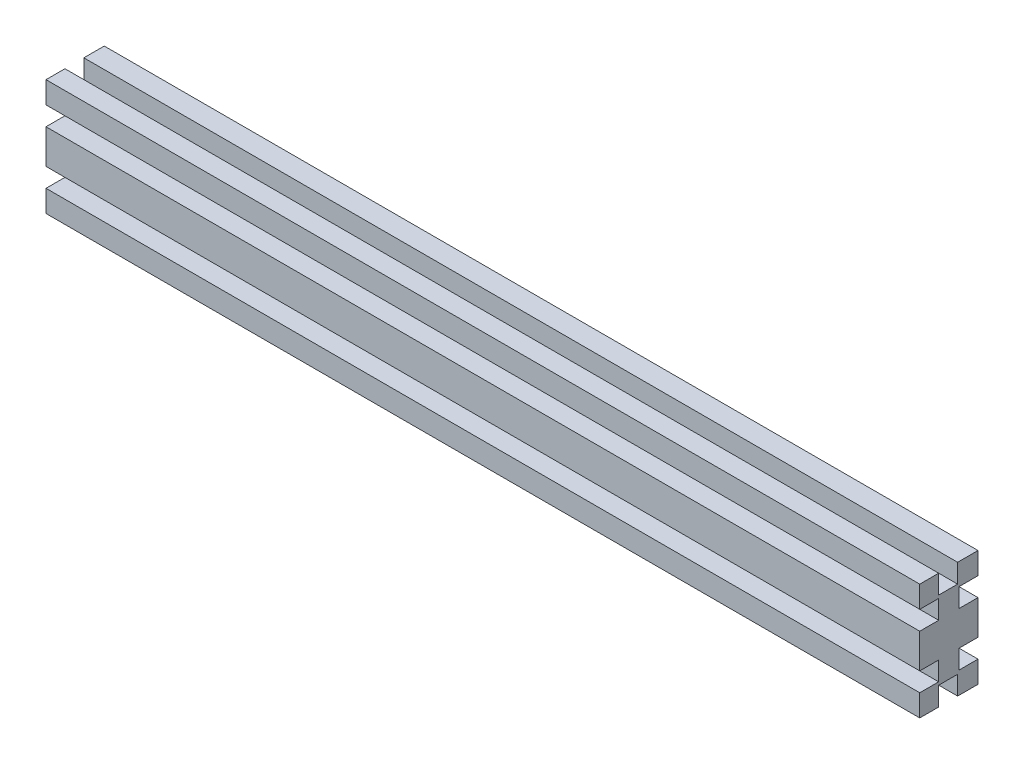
ISO-10303-21;
HEADER;
FILE_DESCRIPTION(('STEP AP214'),'2;1');
FILE_NAME('part.step','',(''),(''),'','','');
FILE_SCHEMA(('AUTOMOTIVE_DESIGN { 1 0 10303 214 1 1 1 1 }'));
ENDSEC;
DATA;
#1=APPLICATION_CONTEXT('core data for automotive mechanical design processes');
#2=APPLICATION_PROTOCOL_DEFINITION('international standard','automotive_design',2000,#1);
#3=PRODUCT_CONTEXT('',#1,'mechanical');
#4=PRODUCT('Part','Part','',(#3));
#5=PRODUCT_RELATED_PRODUCT_CATEGORY('part','',(#4));
#6=PRODUCT_DEFINITION_FORMATION('','',#4);
#7=PRODUCT_DEFINITION_CONTEXT('part definition',#1,'design');
#8=PRODUCT_DEFINITION('design','',#6,#7);
#9=PRODUCT_DEFINITION_SHAPE('','',#8);
#10=(LENGTH_UNIT() NAMED_UNIT(*) SI_UNIT(.MILLI.,.METRE.));
#11=(NAMED_UNIT(*) PLANE_ANGLE_UNIT() SI_UNIT($,.RADIAN.));
#12=(NAMED_UNIT(*) SI_UNIT($,.STERADIAN.) SOLID_ANGLE_UNIT());
#13=UNCERTAINTY_MEASURE_WITH_UNIT(LENGTH_MEASURE(1.E-05),#10,'distance_accuracy_value','');
#14=(GEOMETRIC_REPRESENTATION_CONTEXT(3) GLOBAL_UNCERTAINTY_ASSIGNED_CONTEXT((#13)) GLOBAL_UNIT_ASSIGNED_CONTEXT((#10,
#11,#12)) REPRESENTATION_CONTEXT('',''));
#15=CARTESIAN_POINT('',(0.,0.,0.));
#16=DIRECTION('',(0.,0.,1.));
#17=DIRECTION('',(1.,0.,0.));
#18=AXIS2_PLACEMENT_3D('',#15,#16,#17);
#19=CARTESIAN_POINT('',(300.,-19.9006863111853,-3.));
#20=DIRECTION('',(0.,1.,0.));
#21=DIRECTION('',(0.,0.,1.));
#22=AXIS2_PLACEMENT_3D('',#19,#20,#21);
#23=PLANE('',#22);
#24=DIRECTION('',(0.,0.,-1.));
#25=VECTOR('',#24,1.);
#26=CARTESIAN_POINT('',(0.,-19.9006863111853,-3.));
#27=LINE('',#26,#25);
#28=CARTESIAN_POINT('',(0.,-19.9006863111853,-3.));
#29=VERTEX_POINT('',#28);
#30=CARTESIAN_POINT('',(0.,-19.9006863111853,-10.));
#31=VERTEX_POINT('',#30);
#32=EDGE_CURVE('E266',#29,#31,#27,.T.);
#33=ORIENTED_EDGE('',*,*,#32,.T.);
#34=DIRECTION('',(-1.,0.,0.));
#35=VECTOR('',#34,1.);
#36=CARTESIAN_POINT('',(300.,-19.9006863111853,-10.));
#37=LINE('',#36,#35);
#38=CARTESIAN_POINT('',(300.,-19.9006863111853,-10.));
#39=VERTEX_POINT('',#38);
#40=EDGE_CURVE('E11',#39,#31,#37,.T.);
#41=ORIENTED_EDGE('',*,*,#40,.F.);
#42=DIRECTION('',(0.,0.,-1.));
#43=VECTOR('',#42,1.);
#44=CARTESIAN_POINT('',(300.,-19.9006863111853,-3.));
#45=LINE('',#44,#43);
#46=CARTESIAN_POINT('',(300.,-19.9006863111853,-3.));
#47=VERTEX_POINT('',#46);
#48=EDGE_CURVE('E348',#47,#39,#45,.T.);
#49=ORIENTED_EDGE('',*,*,#48,.F.);
#50=DIRECTION('',(-1.,0.,0.));
#51=VECTOR('',#50,1.);
#52=CARTESIAN_POINT('',(300.,-19.9006863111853,-3.));
#53=LINE('',#52,#51);
#54=EDGE_CURVE('E262',#47,#29,#53,.T.);
#55=ORIENTED_EDGE('',*,*,#54,.T.);
#56=EDGE_LOOP('',(#33,#41,#49,#55));
#57=FACE_BOUND('',#56,.T.);
#58=ADVANCED_FACE('F45',(#57),#23,.F.);
#59=CARTESIAN_POINT('',(300.,-12.4006863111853,-10.));
#60=DIRECTION('',(0.,0.,1.));
#61=DIRECTION('',(0.,-1.,0.));
#62=AXIS2_PLACEMENT_3D('',#59,#60,#61);
#63=PLANE('',#62);
#64=DIRECTION('',(0.,1.,0.));
#65=VECTOR('',#64,1.);
#66=CARTESIAN_POINT('',(0.,-12.4006863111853,-10.));
#67=LINE('',#66,#65);
#68=CARTESIAN_POINT('',(0.,-12.4006863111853,-10.));
#69=VERTEX_POINT('',#68);
#70=EDGE_CURVE('E270',#31,#69,#67,.T.);
#71=ORIENTED_EDGE('',*,*,#70,.T.);
#72=DIRECTION('',(-1.,0.,0.));
#73=VECTOR('',#72,1.);
#74=CARTESIAN_POINT('',(300.,-12.4006863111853,-10.));
#75=LINE('',#74,#73);
#76=CARTESIAN_POINT('',(300.,-12.4006863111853,-10.));
#77=VERTEX_POINT('',#76);
#78=EDGE_CURVE('E54',#77,#69,#75,.T.);
#79=ORIENTED_EDGE('',*,*,#78,.F.);
#80=DIRECTION('',(0.,1.,0.));
#81=VECTOR('',#80,1.);
#82=CARTESIAN_POINT('',(300.,-12.4006863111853,-10.));
#83=LINE('',#82,#81);
#84=EDGE_CURVE('E165',#39,#77,#83,.T.);
#85=ORIENTED_EDGE('',*,*,#84,.F.);
#86=ORIENTED_EDGE('',*,*,#40,.T.);
#87=EDGE_LOOP('',(#71,#79,#85,#86));
#88=FACE_BOUND('',#87,.T.);
#89=ADVANCED_FACE('F554',(#88),#63,.F.);
#90=CARTESIAN_POINT('',(300.,-12.4006863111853,-10.));
#91=DIRECTION('',(0.,-1.,0.));
#92=DIRECTION('',(0.,0.,-1.));
#93=AXIS2_PLACEMENT_3D('',#90,#91,#92);
#94=PLANE('',#93);
#95=DIRECTION('',(0.,0.,1.));
#96=VECTOR('',#95,1.);
#97=CARTESIAN_POINT('',(0.,-12.4006863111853,-10.));
#98=LINE('',#97,#96);
#99=CARTESIAN_POINT('',(0.,-12.4006863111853,-3.49999999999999));
#100=VERTEX_POINT('',#99);
#101=EDGE_CURVE('E273',#69,#100,#98,.T.);
#102=ORIENTED_EDGE('',*,*,#101,.T.);
#103=DIRECTION('',(-1.,0.,0.));
#104=VECTOR('',#103,1.);
#105=CARTESIAN_POINT('',(300.,-12.4006863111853,-3.49999999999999));
#106=LINE('',#105,#104);
#107=CARTESIAN_POINT('',(300.,-12.4006863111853,-3.49999999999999));
#108=VERTEX_POINT('',#107);
#109=EDGE_CURVE('E439',#108,#100,#106,.T.);
#110=ORIENTED_EDGE('',*,*,#109,.F.);
#111=DIRECTION('',(0.,0.,1.));
#112=VECTOR('',#111,1.);
#113=CARTESIAN_POINT('',(300.,-12.4006863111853,-10.));
#114=LINE('',#113,#112);
#115=EDGE_CURVE('E449',#77,#108,#114,.T.);
#116=ORIENTED_EDGE('',*,*,#115,.F.);
#117=ORIENTED_EDGE('',*,*,#78,.T.);
#118=EDGE_LOOP('',(#102,#110,#116,#117));
#119=FACE_BOUND('',#118,.T.);
#120=ADVANCED_FACE('F447',(#119),#94,.F.);
#121=CARTESIAN_POINT('',(300.,-5.90068631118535,-3.49999999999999));
#122=DIRECTION('',(0.,0.,1.));
#123=DIRECTION('',(0.,-1.,0.));
#124=AXIS2_PLACEMENT_3D('',#121,#122,#123);
#125=PLANE('',#124);
#126=DIRECTION('',(0.,1.,0.));
#127=VECTOR('',#126,1.);
#128=CARTESIAN_POINT('',(0.,-5.90068631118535,-3.49999999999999));
#129=LINE('',#128,#127);
#130=CARTESIAN_POINT('',(0.,-5.90068631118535,-3.49999999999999));
#131=VERTEX_POINT('',#130);
#132=EDGE_CURVE('E276',#100,#131,#129,.T.);
#133=ORIENTED_EDGE('',*,*,#132,.T.);
#134=DIRECTION('',(-1.,0.,0.));
#135=VECTOR('',#134,1.);
#136=CARTESIAN_POINT('',(300.,-5.90068631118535,-3.49999999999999));
#137=LINE('',#136,#135);
#138=CARTESIAN_POINT('',(300.,-5.90068631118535,-3.49999999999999));
#139=VERTEX_POINT('',#138);
#140=EDGE_CURVE('E435',#139,#131,#137,.T.);
#141=ORIENTED_EDGE('',*,*,#140,.F.);
#142=DIRECTION('',(0.,1.,0.));
#143=VECTOR('',#142,1.);
#144=CARTESIAN_POINT('',(300.,-5.90068631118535,-3.49999999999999));
#145=LINE('',#144,#143);
#146=EDGE_CURVE('E468',#108,#139,#145,.T.);
#147=ORIENTED_EDGE('',*,*,#146,.F.);
#148=ORIENTED_EDGE('',*,*,#109,.T.);
#149=EDGE_LOOP('',(#133,#141,#147,#148));
#150=FACE_BOUND('',#149,.T.);
#151=ADVANCED_FACE('F458',(#150),#125,.F.);
#152=CARTESIAN_POINT('',(300.,-5.90068631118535,-10.));
#153=DIRECTION('',(0.,1.,0.));
#154=DIRECTION('',(0.,0.,1.));
#155=AXIS2_PLACEMENT_3D('',#152,#153,#154);
#156=PLANE('',#155);
#157=DIRECTION('',(0.,0.,-1.));
#158=VECTOR('',#157,1.);
#159=CARTESIAN_POINT('',(0.,-5.90068631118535,-10.));
#160=LINE('',#159,#158);
#161=CARTESIAN_POINT('',(0.,-5.90068631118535,-10.));
#162=VERTEX_POINT('',#161);
#163=EDGE_CURVE('E279',#131,#162,#160,.T.);
#164=ORIENTED_EDGE('',*,*,#163,.T.);
#165=DIRECTION('',(-1.,0.,0.));
#166=VECTOR('',#165,1.);
#167=CARTESIAN_POINT('',(300.,-5.90068631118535,-10.));
#168=LINE('',#167,#166);
#169=CARTESIAN_POINT('',(300.,-5.90068631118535,-10.));
#170=VERTEX_POINT('',#169);
#171=EDGE_CURVE('E431',#170,#162,#168,.T.);
#172=ORIENTED_EDGE('',*,*,#171,.F.);
#173=DIRECTION('',(0.,0.,-1.));
#174=VECTOR('',#173,1.);
#175=CARTESIAN_POINT('',(300.,-5.90068631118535,-10.));
#176=LINE('',#175,#174);
#177=EDGE_CURVE('E464',#139,#170,#176,.T.);
#178=ORIENTED_EDGE('',*,*,#177,.F.);
#179=ORIENTED_EDGE('',*,*,#140,.T.);
#180=EDGE_LOOP('',(#164,#172,#178,#179));
#181=FACE_BOUND('',#180,.T.);
#182=ADVANCED_FACE('F462',(#181),#156,.F.);
#183=CARTESIAN_POINT('',(300.,5.90068631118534,-10.));
#184=DIRECTION('',(0.,0.,1.));
#185=DIRECTION('',(0.,-1.,0.));
#186=AXIS2_PLACEMENT_3D('',#183,#184,#185);
#187=PLANE('',#186);
#188=DIRECTION('',(0.,1.,0.));
#189=VECTOR('',#188,1.);
#190=CARTESIAN_POINT('',(0.,5.90068631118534,-10.));
#191=LINE('',#190,#189);
#192=CARTESIAN_POINT('',(0.,5.90068631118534,-10.));
#193=VERTEX_POINT('',#192);
#194=EDGE_CURVE('E282',#162,#193,#191,.T.);
#195=ORIENTED_EDGE('',*,*,#194,.T.);
#196=DIRECTION('',(-1.,0.,0.));
#197=VECTOR('',#196,1.);
#198=CARTESIAN_POINT('',(300.,5.90068631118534,-10.));
#199=LINE('',#198,#197);
#200=CARTESIAN_POINT('',(300.,5.90068631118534,-10.));
#201=VERTEX_POINT('',#200);
#202=EDGE_CURVE('E427',#201,#193,#199,.T.);
#203=ORIENTED_EDGE('',*,*,#202,.F.);
#204=DIRECTION('',(0.,1.,0.));
#205=VECTOR('',#204,1.);
#206=CARTESIAN_POINT('',(300.,5.90068631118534,-10.));
#207=LINE('',#206,#205);
#208=EDGE_CURVE('E467',#170,#201,#207,.T.);
#209=ORIENTED_EDGE('',*,*,#208,.F.);
#210=ORIENTED_EDGE('',*,*,#171,.T.);
#211=EDGE_LOOP('',(#195,#203,#209,#210));
#212=FACE_BOUND('',#211,.T.);
#213=ADVANCED_FACE('F567',(#212),#187,.F.);
#214=CARTESIAN_POINT('',(300.,5.90068631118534,-10.));
#215=DIRECTION('',(0.,-1.,0.));
#216=DIRECTION('',(0.,0.,-1.));
#217=AXIS2_PLACEMENT_3D('',#214,#215,#216);
#218=PLANE('',#217);
#219=DIRECTION('',(0.,0.,1.));
#220=VECTOR('',#219,1.);
#221=CARTESIAN_POINT('',(0.,5.90068631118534,-10.));
#222=LINE('',#221,#220);
#223=CARTESIAN_POINT('',(0.,5.90068631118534,-3.5));
#224=VERTEX_POINT('',#223);
#225=EDGE_CURVE('E285',#193,#224,#222,.T.);
#226=ORIENTED_EDGE('',*,*,#225,.T.);
#227=DIRECTION('',(-1.,0.,0.));
#228=VECTOR('',#227,1.);
#229=CARTESIAN_POINT('',(300.,5.90068631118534,-3.5));
#230=LINE('',#229,#228);
#231=CARTESIAN_POINT('',(300.,5.90068631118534,-3.5));
#232=VERTEX_POINT('',#231);
#233=EDGE_CURVE('E423',#232,#224,#230,.T.);
#234=ORIENTED_EDGE('',*,*,#233,.F.);
#235=DIRECTION('',(0.,0.,1.));
#236=VECTOR('',#235,1.);
#237=CARTESIAN_POINT('',(300.,5.90068631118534,-10.));
#238=LINE('',#237,#236);
#239=EDGE_CURVE('E472',#201,#232,#238,.T.);
#240=ORIENTED_EDGE('',*,*,#239,.F.);
#241=ORIENTED_EDGE('',*,*,#202,.T.);
#242=EDGE_LOOP('',(#226,#234,#240,#241));
#243=FACE_BOUND('',#242,.T.);
#244=ADVANCED_FACE('F570',(#243),#218,.F.);
#245=CARTESIAN_POINT('',(300.,12.4006863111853,-3.5));
#246=DIRECTION('',(0.,0.,1.));
#247=DIRECTION('',(1.,0.,0.));
#248=AXIS2_PLACEMENT_3D('',#245,#246,#247);
#249=PLANE('',#248);
#250=DIRECTION('',(0.,1.,0.));
#251=VECTOR('',#250,1.);
#252=CARTESIAN_POINT('',(0.,12.4006863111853,-3.5));
#253=LINE('',#252,#251);
#254=CARTESIAN_POINT('',(0.,12.4006863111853,-3.5));
#255=VERTEX_POINT('',#254);
#256=EDGE_CURVE('E288',#224,#255,#253,.T.);
#257=ORIENTED_EDGE('',*,*,#256,.T.);
#258=DIRECTION('',(-1.,0.,0.));
#259=VECTOR('',#258,1.);
#260=CARTESIAN_POINT('',(300.,12.4006863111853,-3.5));
#261=LINE('',#260,#259);
#262=CARTESIAN_POINT('',(300.,12.4006863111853,-3.5));
#263=VERTEX_POINT('',#262);
#264=EDGE_CURVE('E419',#263,#255,#261,.T.);
#265=ORIENTED_EDGE('',*,*,#264,.F.);
#266=DIRECTION('',(0.,1.,0.));
#267=VECTOR('',#266,1.);
#268=CARTESIAN_POINT('',(300.,12.4006863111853,-3.5));
#269=LINE('',#268,#267);
#270=EDGE_CURVE('E479',#232,#263,#269,.T.);
#271=ORIENTED_EDGE('',*,*,#270,.F.);
#272=ORIENTED_EDGE('',*,*,#233,.T.);
#273=EDGE_LOOP('',(#257,#265,#271,#272));
#274=FACE_BOUND('',#273,.T.);
#275=ADVANCED_FACE('F574',(#274),#249,.F.);
#276=CARTESIAN_POINT('',(300.,12.4006863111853,-10.));
#277=DIRECTION('',(0.,1.,0.));
#278=DIRECTION('',(0.,0.,1.));
#279=AXIS2_PLACEMENT_3D('',#276,#277,#278);
#280=PLANE('',#279);
#281=DIRECTION('',(0.,0.,-1.));
#282=VECTOR('',#281,1.);
#283=CARTESIAN_POINT('',(0.,12.4006863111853,-10.));
#284=LINE('',#283,#282);
#285=CARTESIAN_POINT('',(0.,12.4006863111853,-10.));
#286=VERTEX_POINT('',#285);
#287=EDGE_CURVE('E291',#255,#286,#284,.T.);
#288=ORIENTED_EDGE('',*,*,#287,.T.);
#289=DIRECTION('',(-1.,0.,0.));
#290=VECTOR('',#289,1.);
#291=CARTESIAN_POINT('',(300.,12.4006863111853,-10.));
#292=LINE('',#291,#290);
#293=CARTESIAN_POINT('',(300.,12.4006863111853,-10.));
#294=VERTEX_POINT('',#293);
#295=EDGE_CURVE('E415',#294,#286,#292,.T.);
#296=ORIENTED_EDGE('',*,*,#295,.F.);
#297=DIRECTION('',(0.,0.,-1.));
#298=VECTOR('',#297,1.);
#299=CARTESIAN_POINT('',(300.,12.4006863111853,-10.));
#300=LINE('',#299,#298);
#301=EDGE_CURVE('E482',#263,#294,#300,.T.);
#302=ORIENTED_EDGE('',*,*,#301,.F.);
#303=ORIENTED_EDGE('',*,*,#264,.T.);
#304=EDGE_LOOP('',(#288,#296,#302,#303));
#305=FACE_BOUND('',#304,.T.);
#306=ADVANCED_FACE('F578',(#305),#280,.F.);
#307=CARTESIAN_POINT('',(300.,19.9006863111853,-10.));
#308=DIRECTION('',(0.,0.,1.));
#309=DIRECTION('',(0.,-1.,0.));
#310=AXIS2_PLACEMENT_3D('',#307,#308,#309);
#311=PLANE('',#310);
#312=DIRECTION('',(0.,1.,0.));
#313=VECTOR('',#312,1.);
#314=CARTESIAN_POINT('',(0.,19.9006863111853,-10.));
#315=LINE('',#314,#313);
#316=CARTESIAN_POINT('',(0.,19.9006863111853,-10.));
#317=VERTEX_POINT('',#316);
#318=EDGE_CURVE('E294',#286,#317,#315,.T.);
#319=ORIENTED_EDGE('',*,*,#318,.T.);
#320=DIRECTION('',(-1.,0.,0.));
#321=VECTOR('',#320,1.);
#322=CARTESIAN_POINT('',(300.,19.9006863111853,-10.));
#323=LINE('',#322,#321);
#324=CARTESIAN_POINT('',(300.,19.9006863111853,-10.));
#325=VERTEX_POINT('',#324);
#326=EDGE_CURVE('E411',#325,#317,#323,.T.);
#327=ORIENTED_EDGE('',*,*,#326,.F.);
#328=DIRECTION('',(0.,1.,0.));
#329=VECTOR('',#328,1.);
#330=CARTESIAN_POINT('',(300.,19.9006863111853,-10.));
#331=LINE('',#330,#329);
#332=EDGE_CURVE('E485',#294,#325,#331,.T.);
#333=ORIENTED_EDGE('',*,*,#332,.F.);
#334=ORIENTED_EDGE('',*,*,#295,.T.);
#335=EDGE_LOOP('',(#319,#327,#333,#334));
#336=FACE_BOUND('',#335,.T.);
#337=ADVANCED_FACE('F582',(#336),#311,.F.);
#338=CARTESIAN_POINT('',(300.,19.9006863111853,-3.));
#339=DIRECTION('',(0.,-1.,0.));
#340=DIRECTION('',(0.,0.,-1.));
#341=AXIS2_PLACEMENT_3D('',#338,#339,#340);
#342=PLANE('',#341);
#343=DIRECTION('',(0.,0.,1.));
#344=VECTOR('',#343,1.);
#345=CARTESIAN_POINT('',(0.,19.9006863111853,-3.));
#346=LINE('',#345,#344);
#347=CARTESIAN_POINT('',(0.,19.9006863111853,-3.));
#348=VERTEX_POINT('',#347);
#349=EDGE_CURVE('E297',#317,#348,#346,.T.);
#350=ORIENTED_EDGE('',*,*,#349,.T.);
#351=DIRECTION('',(-1.,0.,0.));
#352=VECTOR('',#351,1.);
#353=CARTESIAN_POINT('',(300.,19.9006863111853,-3.));
#354=LINE('',#353,#352);
#355=CARTESIAN_POINT('',(300.,19.9006863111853,-3.));
#356=VERTEX_POINT('',#355);
#357=EDGE_CURVE('E407',#356,#348,#354,.T.);
#358=ORIENTED_EDGE('',*,*,#357,.F.);
#359=DIRECTION('',(0.,0.,1.));
#360=VECTOR('',#359,1.);
#361=CARTESIAN_POINT('',(300.,19.9006863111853,-3.));
#362=LINE('',#361,#360);
#363=EDGE_CURVE('E488',#325,#356,#362,.T.);
#364=ORIENTED_EDGE('',*,*,#363,.F.);
#365=ORIENTED_EDGE('',*,*,#326,.T.);
#366=EDGE_LOOP('',(#350,#358,#364,#365));
#367=FACE_BOUND('',#366,.T.);
#368=ADVANCED_FACE('F586',(#367),#342,.F.);
#369=CARTESIAN_POINT('',(300.,19.9006863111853,-3.));
#370=DIRECTION('',(0.,0.,-1.));
#371=DIRECTION('',(0.,1.,0.));
#372=AXIS2_PLACEMENT_3D('',#369,#370,#371);
#373=PLANE('',#372);
#374=DIRECTION('',(0.,-1.,0.));
#375=VECTOR('',#374,1.);
#376=CARTESIAN_POINT('',(0.,19.9006863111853,-3.));
#377=LINE('',#376,#375);
#378=CARTESIAN_POINT('',(0.,13.4006863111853,-3.));
#379=VERTEX_POINT('',#378);
#380=EDGE_CURVE('E300',#348,#379,#377,.T.);
#381=ORIENTED_EDGE('',*,*,#380,.T.);
#382=DIRECTION('',(-1.,0.,0.));
#383=VECTOR('',#382,1.);
#384=CARTESIAN_POINT('',(300.,13.4006863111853,-3.));
#385=LINE('',#384,#383);
#386=CARTESIAN_POINT('',(300.,13.4006863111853,-3.));
#387=VERTEX_POINT('',#386);
#388=EDGE_CURVE('E403',#387,#379,#385,.T.);
#389=ORIENTED_EDGE('',*,*,#388,.F.);
#390=DIRECTION('',(0.,-1.,0.));
#391=VECTOR('',#390,1.);
#392=CARTESIAN_POINT('',(300.,19.9006863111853,-3.));
#393=LINE('',#392,#391);
#394=EDGE_CURVE('E491',#356,#387,#393,.T.);
#395=ORIENTED_EDGE('',*,*,#394,.F.);
#396=ORIENTED_EDGE('',*,*,#357,.T.);
#397=EDGE_LOOP('',(#381,#389,#395,#396));
#398=FACE_BOUND('',#397,.T.);
#399=ADVANCED_FACE('F590',(#398),#373,.F.);
#400=CARTESIAN_POINT('',(300.,13.4006863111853,3.5));
#401=DIRECTION('',(0.,-1.,0.));
#402=DIRECTION('',(0.,0.,-1.));
#403=AXIS2_PLACEMENT_3D('',#400,#401,#402);
#404=PLANE('',#403);
#405=DIRECTION('',(0.,0.,1.));
#406=VECTOR('',#405,1.);
#407=CARTESIAN_POINT('',(0.,13.4006863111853,3.5));
#408=LINE('',#407,#406);
#409=CARTESIAN_POINT('',(0.,13.4006863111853,3.5));
#410=VERTEX_POINT('',#409);
#411=EDGE_CURVE('E303',#379,#410,#408,.T.);
#412=ORIENTED_EDGE('',*,*,#411,.T.);
#413=DIRECTION('',(-1.,0.,0.));
#414=VECTOR('',#413,1.);
#415=CARTESIAN_POINT('',(300.,13.4006863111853,3.5));
#416=LINE('',#415,#414);
#417=CARTESIAN_POINT('',(300.,13.4006863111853,3.5));
#418=VERTEX_POINT('',#417);
#419=EDGE_CURVE('E399',#418,#410,#416,.T.);
#420=ORIENTED_EDGE('',*,*,#419,.F.);
#421=DIRECTION('',(0.,0.,1.));
#422=VECTOR('',#421,1.);
#423=CARTESIAN_POINT('',(300.,13.4006863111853,3.5));
#424=LINE('',#423,#422);
#425=EDGE_CURVE('E494',#387,#418,#424,.T.);
#426=ORIENTED_EDGE('',*,*,#425,.F.);
#427=ORIENTED_EDGE('',*,*,#388,.T.);
#428=EDGE_LOOP('',(#412,#420,#426,#427));
#429=FACE_BOUND('',#428,.T.);
#430=ADVANCED_FACE('F594',(#429),#404,.F.);
#431=CARTESIAN_POINT('',(300.,19.9006863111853,3.5));
#432=DIRECTION('',(0.,0.,1.));
#433=DIRECTION('',(0.,-1.,0.));
#434=AXIS2_PLACEMENT_3D('',#431,#432,#433);
#435=PLANE('',#434);
#436=DIRECTION('',(0.,1.,0.));
#437=VECTOR('',#436,1.);
#438=CARTESIAN_POINT('',(0.,19.9006863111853,3.5));
#439=LINE('',#438,#437);
#440=CARTESIAN_POINT('',(0.,19.9006863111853,3.5));
#441=VERTEX_POINT('',#440);
#442=EDGE_CURVE('E306',#410,#441,#439,.T.);
#443=ORIENTED_EDGE('',*,*,#442,.T.);
#444=DIRECTION('',(-1.,0.,0.));
#445=VECTOR('',#444,1.);
#446=CARTESIAN_POINT('',(300.,19.9006863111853,3.5));
#447=LINE('',#446,#445);
#448=CARTESIAN_POINT('',(300.,19.9006863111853,3.5));
#449=VERTEX_POINT('',#448);
#450=EDGE_CURVE('E395',#449,#441,#447,.T.);
#451=ORIENTED_EDGE('',*,*,#450,.F.);
#452=DIRECTION('',(0.,1.,0.));
#453=VECTOR('',#452,1.);
#454=CARTESIAN_POINT('',(300.,19.9006863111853,3.5));
#455=LINE('',#454,#453);
#456=EDGE_CURVE('E497',#418,#449,#455,.T.);
#457=ORIENTED_EDGE('',*,*,#456,.F.);
#458=ORIENTED_EDGE('',*,*,#419,.T.);
#459=EDGE_LOOP('',(#443,#451,#457,#458));
#460=FACE_BOUND('',#459,.T.);
#461=ADVANCED_FACE('F598',(#460),#435,.F.);
#462=CARTESIAN_POINT('',(300.,19.9006863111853,10.));
#463=DIRECTION('',(0.,-1.,0.));
#464=DIRECTION('',(0.,0.,-1.));
#465=AXIS2_PLACEMENT_3D('',#462,#463,#464);
#466=PLANE('',#465);
#467=DIRECTION('',(0.,0.,1.));
#468=VECTOR('',#467,1.);
#469=CARTESIAN_POINT('',(0.,19.9006863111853,10.));
#470=LINE('',#469,#468);
#471=CARTESIAN_POINT('',(0.,19.9006863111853,10.));
#472=VERTEX_POINT('',#471);
#473=EDGE_CURVE('E309',#441,#472,#470,.T.);
#474=ORIENTED_EDGE('',*,*,#473,.T.);
#475=DIRECTION('',(-1.,0.,0.));
#476=VECTOR('',#475,1.);
#477=CARTESIAN_POINT('',(300.,19.9006863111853,10.));
#478=LINE('',#477,#476);
#479=CARTESIAN_POINT('',(300.,19.9006863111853,10.));
#480=VERTEX_POINT('',#479);
#481=EDGE_CURVE('E391',#480,#472,#478,.T.);
#482=ORIENTED_EDGE('',*,*,#481,.F.);
#483=DIRECTION('',(0.,0.,1.));
#484=VECTOR('',#483,1.);
#485=CARTESIAN_POINT('',(300.,19.9006863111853,10.));
#486=LINE('',#485,#484);
#487=EDGE_CURVE('E500',#449,#480,#486,.T.);
#488=ORIENTED_EDGE('',*,*,#487,.F.);
#489=ORIENTED_EDGE('',*,*,#450,.T.);
#490=EDGE_LOOP('',(#474,#482,#488,#489));
#491=FACE_BOUND('',#490,.T.);
#492=ADVANCED_FACE('F602',(#491),#466,.F.);
#493=CARTESIAN_POINT('',(300.,19.9006863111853,10.));
#494=DIRECTION('',(0.,0.,-1.));
#495=DIRECTION('',(-1.,0.,0.));
#496=AXIS2_PLACEMENT_3D('',#493,#494,#495);
#497=PLANE('',#496);
#498=DIRECTION('',(0.,-1.,0.));
#499=VECTOR('',#498,1.);
#500=CARTESIAN_POINT('',(0.,19.9006863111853,10.));
#501=LINE('',#500,#499);
#502=CARTESIAN_POINT('',(0.,12.4006863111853,10.));
#503=VERTEX_POINT('',#502);
#504=EDGE_CURVE('E312',#472,#503,#501,.T.);
#505=ORIENTED_EDGE('',*,*,#504,.T.);
#506=DIRECTION('',(-1.,0.,0.));
#507=VECTOR('',#506,1.);
#508=CARTESIAN_POINT('',(300.,12.4006863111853,10.));
#509=LINE('',#508,#507);
#510=CARTESIAN_POINT('',(300.,12.4006863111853,10.));
#511=VERTEX_POINT('',#510);
#512=EDGE_CURVE('E387',#511,#503,#509,.T.);
#513=ORIENTED_EDGE('',*,*,#512,.F.);
#514=DIRECTION('',(0.,-1.,0.));
#515=VECTOR('',#514,1.);
#516=CARTESIAN_POINT('',(300.,19.9006863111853,10.));
#517=LINE('',#516,#515);
#518=EDGE_CURVE('E503',#480,#511,#517,.T.);
#519=ORIENTED_EDGE('',*,*,#518,.F.);
#520=ORIENTED_EDGE('',*,*,#481,.T.);
#521=EDGE_LOOP('',(#505,#513,#519,#520));
#522=FACE_BOUND('',#521,.T.);
#523=ADVANCED_FACE('F606',(#522),#497,.F.);
#524=CARTESIAN_POINT('',(300.,12.4006863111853,10.));
#525=DIRECTION('',(0.,1.,0.));
#526=DIRECTION('',(0.,0.,1.));
#527=AXIS2_PLACEMENT_3D('',#524,#525,#526);
#528=PLANE('',#527);
#529=DIRECTION('',(0.,0.,-1.));
#530=VECTOR('',#529,1.);
#531=CARTESIAN_POINT('',(0.,12.4006863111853,10.));
#532=LINE('',#531,#530);
#533=CARTESIAN_POINT('',(0.,12.4006863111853,3.5));
#534=VERTEX_POINT('',#533);
#535=EDGE_CURVE('E315',#503,#534,#532,.T.);
#536=ORIENTED_EDGE('',*,*,#535,.T.);
#537=DIRECTION('',(-1.,0.,0.));
#538=VECTOR('',#537,1.);
#539=CARTESIAN_POINT('',(300.,12.4006863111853,3.5));
#540=LINE('',#539,#538);
#541=CARTESIAN_POINT('',(300.,12.4006863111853,3.5));
#542=VERTEX_POINT('',#541);
#543=EDGE_CURVE('E383',#542,#534,#540,.T.);
#544=ORIENTED_EDGE('',*,*,#543,.F.);
#545=DIRECTION('',(0.,0.,-1.));
#546=VECTOR('',#545,1.);
#547=CARTESIAN_POINT('',(300.,12.4006863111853,10.));
#548=LINE('',#547,#546);
#549=EDGE_CURVE('E506',#511,#542,#548,.T.);
#550=ORIENTED_EDGE('',*,*,#549,.F.);
#551=ORIENTED_EDGE('',*,*,#512,.T.);
#552=EDGE_LOOP('',(#536,#544,#550,#551));
#553=FACE_BOUND('',#552,.T.);
#554=ADVANCED_FACE('F610',(#553),#528,.F.);
#555=CARTESIAN_POINT('',(300.,12.4006863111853,3.5));
#556=DIRECTION('',(0.,0.,-1.));
#557=DIRECTION('',(-1.,0.,0.));
#558=AXIS2_PLACEMENT_3D('',#555,#556,#557);
#559=PLANE('',#558);
#560=DIRECTION('',(0.,-1.,0.));
#561=VECTOR('',#560,1.);
#562=CARTESIAN_POINT('',(0.,12.4006863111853,3.5));
#563=LINE('',#562,#561);
#564=CARTESIAN_POINT('',(0.,5.90068631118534,3.5));
#565=VERTEX_POINT('',#564);
#566=EDGE_CURVE('E318',#534,#565,#563,.T.);
#567=ORIENTED_EDGE('',*,*,#566,.T.);
#568=DIRECTION('',(-1.,0.,0.));
#569=VECTOR('',#568,1.);
#570=CARTESIAN_POINT('',(300.,5.90068631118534,3.5));
#571=LINE('',#570,#569);
#572=CARTESIAN_POINT('',(300.,5.90068631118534,3.5));
#573=VERTEX_POINT('',#572);
#574=EDGE_CURVE('E379',#573,#565,#571,.T.);
#575=ORIENTED_EDGE('',*,*,#574,.F.);
#576=DIRECTION('',(0.,-1.,0.));
#577=VECTOR('',#576,1.);
#578=CARTESIAN_POINT('',(300.,12.4006863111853,3.5));
#579=LINE('',#578,#577);
#580=EDGE_CURVE('E509',#542,#573,#579,.T.);
#581=ORIENTED_EDGE('',*,*,#580,.F.);
#582=ORIENTED_EDGE('',*,*,#543,.T.);
#583=EDGE_LOOP('',(#567,#575,#581,#582));
#584=FACE_BOUND('',#583,.T.);
#585=ADVANCED_FACE('F614',(#584),#559,.F.);
#586=CARTESIAN_POINT('',(300.,5.90068631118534,10.));
#587=DIRECTION('',(0.,-1.,0.));
#588=DIRECTION('',(0.,0.,-1.));
#589=AXIS2_PLACEMENT_3D('',#586,#587,#588);
#590=PLANE('',#589);
#591=DIRECTION('',(0.,0.,1.));
#592=VECTOR('',#591,1.);
#593=CARTESIAN_POINT('',(0.,5.90068631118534,10.));
#594=LINE('',#593,#592);
#595=CARTESIAN_POINT('',(0.,5.90068631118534,10.));
#596=VERTEX_POINT('',#595);
#597=EDGE_CURVE('E321',#565,#596,#594,.T.);
#598=ORIENTED_EDGE('',*,*,#597,.T.);
#599=DIRECTION('',(-1.,0.,0.));
#600=VECTOR('',#599,1.);
#601=CARTESIAN_POINT('',(300.,5.90068631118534,10.));
#602=LINE('',#601,#600);
#603=CARTESIAN_POINT('',(300.,5.90068631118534,10.));
#604=VERTEX_POINT('',#603);
#605=EDGE_CURVE('E375',#604,#596,#602,.T.);
#606=ORIENTED_EDGE('',*,*,#605,.F.);
#607=DIRECTION('',(0.,0.,1.));
#608=VECTOR('',#607,1.);
#609=CARTESIAN_POINT('',(300.,5.90068631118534,10.));
#610=LINE('',#609,#608);
#611=EDGE_CURVE('E512',#573,#604,#610,.T.);
#612=ORIENTED_EDGE('',*,*,#611,.F.);
#613=ORIENTED_EDGE('',*,*,#574,.T.);
#614=EDGE_LOOP('',(#598,#606,#612,#613));
#615=FACE_BOUND('',#614,.T.);
#616=ADVANCED_FACE('F618',(#615),#590,.F.);
#617=CARTESIAN_POINT('',(300.,5.90068631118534,10.));
#618=DIRECTION('',(0.,0.,-1.));
#619=DIRECTION('',(0.,1.,0.));
#620=AXIS2_PLACEMENT_3D('',#617,#618,#619);
#621=PLANE('',#620);
#622=DIRECTION('',(0.,-1.,0.));
#623=VECTOR('',#622,1.);
#624=CARTESIAN_POINT('',(0.,5.90068631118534,10.));
#625=LINE('',#624,#623);
#626=CARTESIAN_POINT('',(0.,-5.90068631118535,10.));
#627=VERTEX_POINT('',#626);
#628=EDGE_CURVE('E324',#596,#627,#625,.T.);
#629=ORIENTED_EDGE('',*,*,#628,.T.);
#630=DIRECTION('',(-1.,0.,0.));
#631=VECTOR('',#630,1.);
#632=CARTESIAN_POINT('',(300.,-5.90068631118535,10.));
#633=LINE('',#632,#631);
#634=CARTESIAN_POINT('',(300.,-5.90068631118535,10.));
#635=VERTEX_POINT('',#634);
#636=EDGE_CURVE('E371',#635,#627,#633,.T.);
#637=ORIENTED_EDGE('',*,*,#636,.F.);
#638=DIRECTION('',(0.,-1.,0.));
#639=VECTOR('',#638,1.);
#640=CARTESIAN_POINT('',(300.,5.90068631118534,10.));
#641=LINE('',#640,#639);
#642=EDGE_CURVE('E515',#604,#635,#641,.T.);
#643=ORIENTED_EDGE('',*,*,#642,.F.);
#644=ORIENTED_EDGE('',*,*,#605,.T.);
#645=EDGE_LOOP('',(#629,#637,#643,#644));
#646=FACE_BOUND('',#645,.T.);
#647=ADVANCED_FACE('F622',(#646),#621,.F.);
#648=CARTESIAN_POINT('',(300.,-5.90068631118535,10.));
#649=DIRECTION('',(0.,1.,0.));
#650=DIRECTION('',(0.,0.,1.));
#651=AXIS2_PLACEMENT_3D('',#648,#649,#650);
#652=PLANE('',#651);
#653=DIRECTION('',(0.,0.,-1.));
#654=VECTOR('',#653,1.);
#655=CARTESIAN_POINT('',(0.,-5.90068631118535,10.));
#656=LINE('',#655,#654);
#657=CARTESIAN_POINT('',(0.,-5.90068631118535,3.49999999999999));
#658=VERTEX_POINT('',#657);
#659=EDGE_CURVE('E327',#627,#658,#656,.T.);
#660=ORIENTED_EDGE('',*,*,#659,.T.);
#661=DIRECTION('',(-1.,0.,0.));
#662=VECTOR('',#661,1.);
#663=CARTESIAN_POINT('',(300.,-5.90068631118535,3.49999999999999));
#664=LINE('',#663,#662);
#665=CARTESIAN_POINT('',(300.,-5.90068631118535,3.49999999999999));
#666=VERTEX_POINT('',#665);
#667=EDGE_CURVE('E367',#666,#658,#664,.T.);
#668=ORIENTED_EDGE('',*,*,#667,.F.);
#669=DIRECTION('',(0.,0.,-1.));
#670=VECTOR('',#669,1.);
#671=CARTESIAN_POINT('',(300.,-5.90068631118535,10.));
#672=LINE('',#671,#670);
#673=EDGE_CURVE('E518',#635,#666,#672,.T.);
#674=ORIENTED_EDGE('',*,*,#673,.F.);
#675=ORIENTED_EDGE('',*,*,#636,.T.);
#676=EDGE_LOOP('',(#660,#668,#674,#675));
#677=FACE_BOUND('',#676,.T.);
#678=ADVANCED_FACE('F626',(#677),#652,.F.);
#679=CARTESIAN_POINT('',(300.,-5.90068631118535,3.49999999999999));
#680=DIRECTION('',(0.,0.,-1.));
#681=DIRECTION('',(0.,1.,0.));
#682=AXIS2_PLACEMENT_3D('',#679,#680,#681);
#683=PLANE('',#682);
#684=DIRECTION('',(0.,-1.,0.));
#685=VECTOR('',#684,1.);
#686=CARTESIAN_POINT('',(0.,-5.90068631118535,3.49999999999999));
#687=LINE('',#686,#685);
#688=CARTESIAN_POINT('',(0.,-12.4006863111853,3.49999999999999));
#689=VERTEX_POINT('',#688);
#690=EDGE_CURVE('E330',#658,#689,#687,.T.);
#691=ORIENTED_EDGE('',*,*,#690,.T.);
#692=DIRECTION('',(-1.,0.,0.));
#693=VECTOR('',#692,1.);
#694=CARTESIAN_POINT('',(300.,-12.4006863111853,3.49999999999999));
#695=LINE('',#694,#693);
#696=CARTESIAN_POINT('',(300.,-12.4006863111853,3.49999999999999));
#697=VERTEX_POINT('',#696);
#698=EDGE_CURVE('E363',#697,#689,#695,.T.);
#699=ORIENTED_EDGE('',*,*,#698,.F.);
#700=DIRECTION('',(0.,-1.,0.));
#701=VECTOR('',#700,1.);
#702=CARTESIAN_POINT('',(300.,-5.90068631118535,3.49999999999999));
#703=LINE('',#702,#701);
#704=EDGE_CURVE('E521',#666,#697,#703,.T.);
#705=ORIENTED_EDGE('',*,*,#704,.F.);
#706=ORIENTED_EDGE('',*,*,#667,.T.);
#707=EDGE_LOOP('',(#691,#699,#705,#706));
#708=FACE_BOUND('',#707,.T.);
#709=ADVANCED_FACE('F630',(#708),#683,.F.);
#710=CARTESIAN_POINT('',(300.,-12.4006863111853,10.));
#711=DIRECTION('',(0.,-1.,0.));
#712=DIRECTION('',(0.,0.,-1.));
#713=AXIS2_PLACEMENT_3D('',#710,#711,#712);
#714=PLANE('',#713);
#715=DIRECTION('',(0.,0.,1.));
#716=VECTOR('',#715,1.);
#717=CARTESIAN_POINT('',(0.,-12.4006863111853,10.));
#718=LINE('',#717,#716);
#719=CARTESIAN_POINT('',(0.,-12.4006863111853,10.));
#720=VERTEX_POINT('',#719);
#721=EDGE_CURVE('E333',#689,#720,#718,.T.);
#722=ORIENTED_EDGE('',*,*,#721,.T.);
#723=DIRECTION('',(-1.,0.,0.));
#724=VECTOR('',#723,1.);
#725=CARTESIAN_POINT('',(300.,-12.4006863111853,10.));
#726=LINE('',#725,#724);
#727=CARTESIAN_POINT('',(300.,-12.4006863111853,10.));
#728=VERTEX_POINT('',#727);
#729=EDGE_CURVE('E359',#728,#720,#726,.T.);
#730=ORIENTED_EDGE('',*,*,#729,.F.);
#731=DIRECTION('',(0.,0.,1.));
#732=VECTOR('',#731,1.);
#733=CARTESIAN_POINT('',(300.,-12.4006863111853,10.));
#734=LINE('',#733,#732);
#735=EDGE_CURVE('E524',#697,#728,#734,.T.);
#736=ORIENTED_EDGE('',*,*,#735,.F.);
#737=ORIENTED_EDGE('',*,*,#698,.T.);
#738=EDGE_LOOP('',(#722,#730,#736,#737));
#739=FACE_BOUND('',#738,.T.);
#740=ADVANCED_FACE('F634',(#739),#714,.F.);
#741=CARTESIAN_POINT('',(300.,-12.4006863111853,10.));
#742=DIRECTION('',(0.,0.,-1.));
#743=DIRECTION('',(0.,1.,0.));
#744=AXIS2_PLACEMENT_3D('',#741,#742,#743);
#745=PLANE('',#744);
#746=DIRECTION('',(0.,-1.,0.));
#747=VECTOR('',#746,1.);
#748=CARTESIAN_POINT('',(0.,-12.4006863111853,10.));
#749=LINE('',#748,#747);
#750=CARTESIAN_POINT('',(0.,-19.9006863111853,10.));
#751=VERTEX_POINT('',#750);
#752=EDGE_CURVE('E336',#720,#751,#749,.T.);
#753=ORIENTED_EDGE('',*,*,#752,.T.);
#754=DIRECTION('',(-1.,0.,0.));
#755=VECTOR('',#754,1.);
#756=CARTESIAN_POINT('',(300.,-19.9006863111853,10.));
#757=LINE('',#756,#755);
#758=CARTESIAN_POINT('',(300.,-19.9006863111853,10.));
#759=VERTEX_POINT('',#758);
#760=EDGE_CURVE('E355',#759,#751,#757,.T.);
#761=ORIENTED_EDGE('',*,*,#760,.F.);
#762=DIRECTION('',(0.,-1.,0.));
#763=VECTOR('',#762,1.);
#764=CARTESIAN_POINT('',(300.,-12.4006863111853,10.));
#765=LINE('',#764,#763);
#766=EDGE_CURVE('E527',#728,#759,#765,.T.);
#767=ORIENTED_EDGE('',*,*,#766,.F.);
#768=ORIENTED_EDGE('',*,*,#729,.T.);
#769=EDGE_LOOP('',(#753,#761,#767,#768));
#770=FACE_BOUND('',#769,.T.);
#771=ADVANCED_FACE('F535',(#770),#745,.F.);
#772=CARTESIAN_POINT('',(300.,-19.9006863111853,10.));
#773=DIRECTION('',(0.,1.,0.));
#774=DIRECTION('',(0.,0.,1.));
#775=AXIS2_PLACEMENT_3D('',#772,#773,#774);
#776=PLANE('',#775);
#777=DIRECTION('',(0.,0.,-1.));
#778=VECTOR('',#777,1.);
#779=CARTESIAN_POINT('',(0.,-19.9006863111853,10.));
#780=LINE('',#779,#778);
#781=CARTESIAN_POINT('',(0.,-19.9006863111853,3.5));
#782=VERTEX_POINT('',#781);
#783=EDGE_CURVE('E339',#751,#782,#780,.T.);
#784=ORIENTED_EDGE('',*,*,#783,.T.);
#785=DIRECTION('',(-1.,0.,0.));
#786=VECTOR('',#785,1.);
#787=CARTESIAN_POINT('',(300.,-19.9006863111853,3.5));
#788=LINE('',#787,#786);
#789=CARTESIAN_POINT('',(300.,-19.9006863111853,3.5));
#790=VERTEX_POINT('',#789);
#791=EDGE_CURVE('E255',#790,#782,#788,.T.);
#792=ORIENTED_EDGE('',*,*,#791,.F.);
#793=DIRECTION('',(0.,0.,-1.));
#794=VECTOR('',#793,1.);
#795=CARTESIAN_POINT('',(300.,-19.9006863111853,10.));
#796=LINE('',#795,#794);
#797=EDGE_CURVE('E244',#759,#790,#796,.T.);
#798=ORIENTED_EDGE('',*,*,#797,.F.);
#799=ORIENTED_EDGE('',*,*,#760,.T.);
#800=EDGE_LOOP('',(#784,#792,#798,#799));
#801=FACE_BOUND('',#800,.T.);
#802=ADVANCED_FACE('F539',(#801),#776,.F.);
#803=CARTESIAN_POINT('',(300.,-19.9006863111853,3.5));
#804=DIRECTION('',(0.,0.,1.));
#805=DIRECTION('',(0.,-1.,0.));
#806=AXIS2_PLACEMENT_3D('',#803,#804,#805);
#807=PLANE('',#806);
#808=DIRECTION('',(0.,1.,0.));
#809=VECTOR('',#808,1.);
#810=CARTESIAN_POINT('',(0.,-19.9006863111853,3.5));
#811=LINE('',#810,#809);
#812=CARTESIAN_POINT('',(0.,-13.4006863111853,3.5));
#813=VERTEX_POINT('',#812);
#814=EDGE_CURVE('E253',#782,#813,#811,.T.);
#815=ORIENTED_EDGE('',*,*,#814,.T.);
#816=DIRECTION('',(-1.,0.,0.));
#817=VECTOR('',#816,1.);
#818=CARTESIAN_POINT('',(300.,-13.4006863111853,3.5));
#819=LINE('',#818,#817);
#820=CARTESIAN_POINT('',(300.,-13.4006863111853,3.5));
#821=VERTEX_POINT('',#820);
#822=EDGE_CURVE('E250',#821,#813,#819,.T.);
#823=ORIENTED_EDGE('',*,*,#822,.F.);
#824=DIRECTION('',(0.,1.,0.));
#825=VECTOR('',#824,1.);
#826=CARTESIAN_POINT('',(300.,-19.9006863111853,3.5));
#827=LINE('',#826,#825);
#828=EDGE_CURVE('E238',#790,#821,#827,.T.);
#829=ORIENTED_EDGE('',*,*,#828,.F.);
#830=ORIENTED_EDGE('',*,*,#791,.T.);
#831=EDGE_LOOP('',(#815,#823,#829,#830));
#832=FACE_BOUND('',#831,.T.);
#833=ADVANCED_FACE('F251',(#832),#807,.F.);
#834=CARTESIAN_POINT('',(300.,-13.4006863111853,3.5));
#835=DIRECTION('',(0.,1.,0.));
#836=DIRECTION('',(0.,0.,1.));
#837=AXIS2_PLACEMENT_3D('',#834,#835,#836);
#838=PLANE('',#837);
#839=DIRECTION('',(0.,0.,-1.));
#840=VECTOR('',#839,1.);
#841=CARTESIAN_POINT('',(0.,-13.4006863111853,3.5));
#842=LINE('',#841,#840);
#843=CARTESIAN_POINT('',(0.,-13.4006863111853,-3.));
#844=VERTEX_POINT('',#843);
#845=EDGE_CURVE('E151',#813,#844,#842,.T.);
#846=ORIENTED_EDGE('',*,*,#845,.T.);
#847=DIRECTION('',(-1.,0.,0.));
#848=VECTOR('',#847,1.);
#849=CARTESIAN_POINT('',(300.,-13.4006863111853,-3.));
#850=LINE('',#849,#848);
#851=CARTESIAN_POINT('',(300.,-13.4006863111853,-3.));
#852=VERTEX_POINT('',#851);
#853=EDGE_CURVE('E256',#852,#844,#850,.T.);
#854=ORIENTED_EDGE('',*,*,#853,.F.);
#855=DIRECTION('',(0.,0.,-1.));
#856=VECTOR('',#855,1.);
#857=CARTESIAN_POINT('',(300.,-13.4006863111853,3.5));
#858=LINE('',#857,#856);
#859=EDGE_CURVE('E242',#821,#852,#858,.T.);
#860=ORIENTED_EDGE('',*,*,#859,.F.);
#861=ORIENTED_EDGE('',*,*,#822,.T.);
#862=EDGE_LOOP('',(#846,#854,#860,#861));
#863=FACE_BOUND('',#862,.T.);
#864=ADVANCED_FACE('F258',(#863),#838,.F.);
#865=CARTESIAN_POINT('',(300.,-19.9006863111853,-3.));
#866=DIRECTION('',(0.,0.,-1.));
#867=DIRECTION('',(0.,1.,0.));
#868=AXIS2_PLACEMENT_3D('',#865,#866,#867);
#869=PLANE('',#868);
#870=DIRECTION('',(0.,-1.,0.));
#871=VECTOR('',#870,1.);
#872=CARTESIAN_POINT('',(0.,-19.9006863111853,-3.));
#873=LINE('',#872,#871);
#874=EDGE_CURVE('E157',#844,#29,#873,.T.);
#875=ORIENTED_EDGE('',*,*,#874,.T.);
#876=ORIENTED_EDGE('',*,*,#54,.F.);
#877=DIRECTION('',(0.,-1.,0.));
#878=VECTOR('',#877,1.);
#879=CARTESIAN_POINT('',(300.,-19.9006863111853,-3.));
#880=LINE('',#879,#878);
#881=EDGE_CURVE('E62',#852,#47,#880,.T.);
#882=ORIENTED_EDGE('',*,*,#881,.F.);
#883=ORIENTED_EDGE('',*,*,#853,.T.);
#884=EDGE_LOOP('',(#875,#876,#882,#883));
#885=FACE_BOUND('',#884,.T.);
#886=ADVANCED_FACE('F543',(#885),#869,.F.);
#887=CARTESIAN_POINT('',(300.,0.,0.));
#888=DIRECTION('',(-1.,0.,0.));
#889=DIRECTION('',(0.,0.,1.));
#890=AXIS2_PLACEMENT_3D('',#887,#888,#889);
#891=PLANE('',#890);
#892=ORIENTED_EDGE('',*,*,#48,.T.);
#893=ORIENTED_EDGE('',*,*,#84,.T.);
#894=ORIENTED_EDGE('',*,*,#115,.T.);
#895=ORIENTED_EDGE('',*,*,#146,.T.);
#896=ORIENTED_EDGE('',*,*,#177,.T.);
#897=ORIENTED_EDGE('',*,*,#208,.T.);
#898=ORIENTED_EDGE('',*,*,#239,.T.);
#899=ORIENTED_EDGE('',*,*,#270,.T.);
#900=ORIENTED_EDGE('',*,*,#301,.T.);
#901=ORIENTED_EDGE('',*,*,#332,.T.);
#902=ORIENTED_EDGE('',*,*,#363,.T.);
#903=ORIENTED_EDGE('',*,*,#394,.T.);
#904=ORIENTED_EDGE('',*,*,#425,.T.);
#905=ORIENTED_EDGE('',*,*,#456,.T.);
#906=ORIENTED_EDGE('',*,*,#487,.T.);
#907=ORIENTED_EDGE('',*,*,#518,.T.);
#908=ORIENTED_EDGE('',*,*,#549,.T.);
#909=ORIENTED_EDGE('',*,*,#580,.T.);
#910=ORIENTED_EDGE('',*,*,#611,.T.);
#911=ORIENTED_EDGE('',*,*,#642,.T.);
#912=ORIENTED_EDGE('',*,*,#673,.T.);
#913=ORIENTED_EDGE('',*,*,#704,.T.);
#914=ORIENTED_EDGE('',*,*,#735,.T.);
#915=ORIENTED_EDGE('',*,*,#766,.T.);
#916=ORIENTED_EDGE('',*,*,#797,.T.);
#917=ORIENTED_EDGE('',*,*,#828,.T.);
#918=ORIENTED_EDGE('',*,*,#859,.T.);
#919=ORIENTED_EDGE('',*,*,#881,.T.);
#920=EDGE_LOOP('',(#892,#893,#894,#895,#896,#897,#898,#899,#900,#901,#902,#903,#904,#905,#906,
#907,#908,#909,#910,#911,#912,#913,#914,#915,#916,#917,#918,#919));
#921=FACE_BOUND('',#920,.T.);
#922=ADVANCED_FACE('F240',(#921),#891,.F.);
#923=CARTESIAN_POINT('',(0.,0.,0.));
#924=DIRECTION('',(-1.,0.,0.));
#925=DIRECTION('',(0.,0.,1.));
#926=AXIS2_PLACEMENT_3D('',#923,#924,#925);
#927=PLANE('',#926);
#928=ORIENTED_EDGE('',*,*,#32,.F.);
#929=ORIENTED_EDGE('',*,*,#874,.F.);
#930=ORIENTED_EDGE('',*,*,#845,.F.);
#931=ORIENTED_EDGE('',*,*,#814,.F.);
#932=ORIENTED_EDGE('',*,*,#783,.F.);
#933=ORIENTED_EDGE('',*,*,#752,.F.);
#934=ORIENTED_EDGE('',*,*,#721,.F.);
#935=ORIENTED_EDGE('',*,*,#690,.F.);
#936=ORIENTED_EDGE('',*,*,#659,.F.);
#937=ORIENTED_EDGE('',*,*,#628,.F.);
#938=ORIENTED_EDGE('',*,*,#597,.F.);
#939=ORIENTED_EDGE('',*,*,#566,.F.);
#940=ORIENTED_EDGE('',*,*,#535,.F.);
#941=ORIENTED_EDGE('',*,*,#504,.F.);
#942=ORIENTED_EDGE('',*,*,#473,.F.);
#943=ORIENTED_EDGE('',*,*,#442,.F.);
#944=ORIENTED_EDGE('',*,*,#411,.F.);
#945=ORIENTED_EDGE('',*,*,#380,.F.);
#946=ORIENTED_EDGE('',*,*,#349,.F.);
#947=ORIENTED_EDGE('',*,*,#318,.F.);
#948=ORIENTED_EDGE('',*,*,#287,.F.);
#949=ORIENTED_EDGE('',*,*,#256,.F.);
#950=ORIENTED_EDGE('',*,*,#225,.F.);
#951=ORIENTED_EDGE('',*,*,#194,.F.);
#952=ORIENTED_EDGE('',*,*,#163,.F.);
#953=ORIENTED_EDGE('',*,*,#132,.F.);
#954=ORIENTED_EDGE('',*,*,#101,.F.);
#955=ORIENTED_EDGE('',*,*,#70,.F.);
#956=EDGE_LOOP('',(#928,#929,#930,#931,#932,#933,#934,#935,#936,#937,#938,#939,#940,#941,#942,
#943,#944,#945,#946,#947,#948,#949,#950,#951,#952,#953,#954,#955));
#957=FACE_BOUND('',#956,.T.);
#958=ADVANCED_FACE('F453',(#957),#927,.T.);
#959=CLOSED_SHELL('',(#58,#89,#120,#151,#182,#213,#244,#275,#306,#337,#368,#399,#430,#461,#492,
#523,#554,#585,#616,#647,#678,#709,#740,#771,#802,#833,#864,#886,#922,#958));
#960=MANIFOLD_SOLID_BREP('B2',#959);
#961=ADVANCED_BREP_SHAPE_REPRESENTATION('',(#18,#960),#14);
#962=SHAPE_DEFINITION_REPRESENTATION(#9,#961);
ENDSEC;
END-ISO-10303-21;
